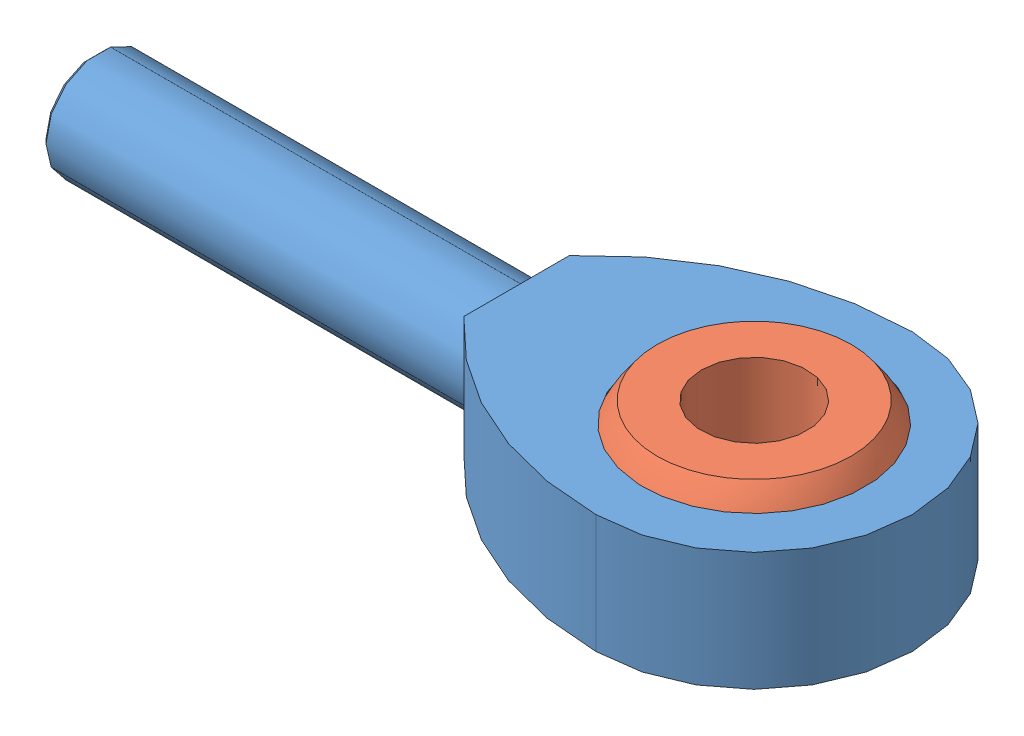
SolidWorks assembly Rod End Assembly.SLDASM, configuration Default (file format 5000). Lengths in mm.
Overall size (49.23 9.53 19.05).
2 component instances, 2 part files, 4 mates.
Components (placement in the parent):
- Rod End Outter-1: Rod End Outter.SLDPRT [Default] at origin size (49.23 7.14 19.05)
- Spherical - Inner-1: Spherical - Inner.SLDPRT [Default] at origin size (15.06 9.53 15.06)
Mates (geometry in assembly coordinates):
- Coincident1: coincident aligned: plane of Rod End Outter-1; plane of assembly
- Coincident2: coincident aligned: plane of Rod End Outter-1; plane of assembly
- Coincident3: coincident aligned: plane of Rod End Outter-1; plane of assembly
- Concentric1: concentric: sphere of Rod End Outter-1; sphere of Spherical - Inner-1
